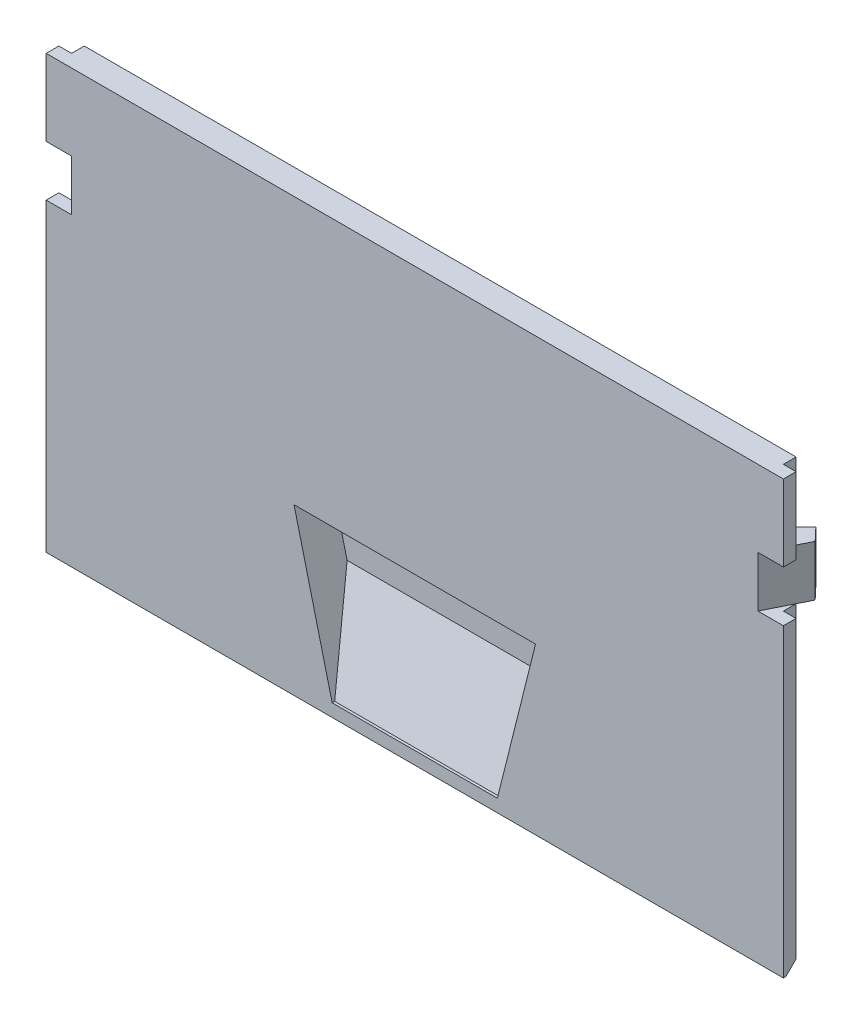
from build123d import *

# Parameters (mm, degrees)
ESQUISSE1_W             = 29
ESQUISSE1_H             = 17
EXTRUSION1_DEPTH        = 1
ESQUISSE2_W             = 0.5
ESQUISSE2_H             = 17
ENL_V_MAT_EXTRU_1_DEPTH = 0.5
ENL_V_MAT_EXTRU_2_DEPTH = 23.366269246
EXTRUSION2_DEPTH        = 1
EXTRUSION3_DEPTH        = 0.5
CHANFREIN1_SIZE         = 3.647124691
CHANFREIN1_SIZE2        = 1.4
ENL_V_MAT_EXTRU_3_DEPTH = 5.25
ESQUISSE7_W             = 1
ESQUISSE7_H             = 2
ENL_V_MAT_EXTRU_4_DEPTH = 23.433234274
EXTRUSION4_DEPTH        = 2
CHANFREIN2_SIZE         = 0.9


with BuildPart() as part:
    # Esquisse1 → Extrusion1 (new body)
    with BuildSketch(Plane.XY):
        with Locations((0, 8.5)):
            Rectangle(ESQUISSE1_W, ESQUISSE1_H)
    extrude(amount=-EXTRUSION1_DEPTH)

    # Esquisse2 → Enl_v. mat.-Extru.1 (cut)
    with BuildSketch(Plane.XY.offset(-1)):
        with Locations((-14.25, 8.5)):
            Rectangle(ESQUISSE2_W, ESQUISSE2_H)
        with Locations((14.25, 8.5)):
            Rectangle(ESQUISSE2_W, ESQUISSE2_H)
    extrude(amount=ENL_V_MAT_EXTRU_1_DEPTH, mode=Mode.SUBTRACT)

    # Esquisse3 → Enl_v. mat.-Extru.2 (cut, through all)
    with BuildSketch(Plane(origin=(0, 0, -1), x_dir=(-1, 0, 0), z_dir=(0, 0, -1))):
        Polygon((-3.25, 0.5), (3.25, 0.5), (4.75, 6.5), (-4.75, 6.5), align=None)
    extrude(amount=-ENL_V_MAT_EXTRU_2_DEPTH, mode=Mode.SUBTRACT)

    # Esquisse4 → Extrusion2 (add)
    with BuildSketch(Plane(origin=(0, 0, -1), x_dir=(-1, 0, 0), z_dir=(0, 0, -1))):
        Polygon((4.155776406, 0), (-4.155776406, 0), (-6.655776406, 10), (6.655776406, 10), align=None)
        Polygon((3.25, 0.5), (5.375, 9), (-5.375, 9), (-3.25, 0.5), align=None, mode=Mode.SUBTRACT)
    extrude(amount=EXTRUSION2_DEPTH)

    # Esquisse5 → Extrusion3 (add)
    with BuildSketch(Plane(origin=(0, 0, -2), x_dir=(-1, 0, 0), z_dir=(0, 0, -1))):
        Polygon((5.780776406, 6.5), (-5.780776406, 6.5), (-4.155776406, 0), (4.155776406, 0), align=None)
    extrude(amount=-EXTRUSION3_DEPTH)

    # Chanfrein1
    chanfrein1_edges = [part.edges().sort_by_distance(p)[0] for p in [
        (0, 0.5, -1.5),
    ]]
    chanfrein1_side = [part.faces().sort_by_distance(p)[0] for p in [
        (0, 3.6875, -1.5),
    ]]
    chamfer(chanfrein1_edges, length=CHANFREIN1_SIZE, length2=CHANFREIN1_SIZE2, reference=chanfrein1_side[0])

    # Esquisse6 → Enl_v. mat.-Extru.3 (cut, symmetric)
    with BuildSketch(Plane(origin=(0, 0, 0), x_dir=(0, 0, -1), z_dir=(1, 0, 0))):
        Polygon((1.5, 1.5), (2, 2), (2, 0), (1.5, 0), align=None)
    extrude(amount=ENL_V_MAT_EXTRU_3_DEPTH, both=True, mode=Mode.SUBTRACT)

    # Esquisse7 → Enl_v. mat.-Extru.4 (cut, through all)
    with BuildSketch(Plane.XY):
        with Locations((-14, 13)):
            Rectangle(ESQUISSE7_W, ESQUISSE7_H)
        with Locations((14, 13)):
            Rectangle(ESQUISSE7_W, ESQUISSE7_H)
    extrude(amount=-ENL_V_MAT_EXTRU_4_DEPTH, mode=Mode.SUBTRACT)

    # Esquisse8 → Extrusion4 (add)
    with BuildSketch(Plane(origin=(0, 12, 0), x_dir=(-1, 0, 0), z_dir=(0, 1, 0))):
        Polygon((13.5, 0), (14.25, -1.5), (13.776595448, -2), (12.720416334, -1), (13.5, -1), align=None)
    extrusion4 = extrude(amount=EXTRUSION4_DEPTH)

    # Sym_trie1: Extrusion4 across plane
    add(extrusion4.mirror(Plane(origin=(0, 0, 0), x_dir=(0, 0, 1), z_dir=(1, 0, 0))))

    # Chanfrein2
    chanfrein2_edges = [part.edges().sort_by_distance(p)[0] for p in [
        (-9.077888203, 0, -1),
        (9.077888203, 0, -1),
    ]]
    chamfer(chanfrein2_edges, length=CHANFREIN2_SIZE)


solid = part.part
